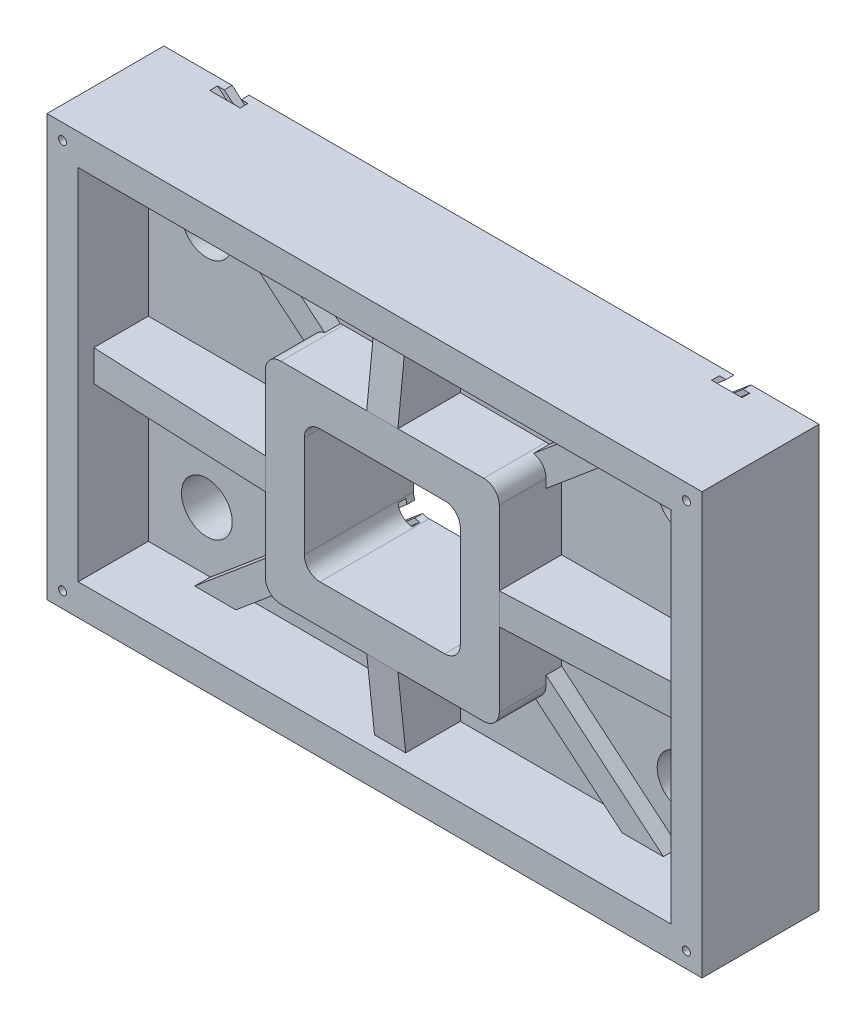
from build123d import *

# Parameters (mm, degrees)
SKETCH_1_W               = 840
SKETCH_1_H               = 540
SKETCH_1_R               = 32.5
EXTRUDE_1_DEPTH          = 150
SKETCH_2_W               = 760
SKETCH_2_H               = 460
CUT_EXTRUDE_1_DEPTH      = 90
CUT_EXTRUDE_3_DEPTH      = 468
CUT_EXTRUDE_3_DEPTH_BACK = 468
CUT_EXTRUDE_4_DEPTH      = 468
CUT_EXTRUDE_4_DEPTH_BACK = 468
EXTRUDE_2_DEPTH          = 80
EXTRUDE_3_DEPTH          = 20
EXTRUDE_3_DEPTH_BACK     = 20
EXTRUDE_4_DEPTH          = 20
EXTRUDE_4_DEPTH_BACK     = 20
EXTRUDE_5_DEPTH          = 20
HOLE_WIZARD_M12_2_D      = 10.2
HOLE_WIZARD_M12_2_DEPTH  = 35.25
HOLE_WIZARD_M12_2_TIP    = 3.064389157


with BuildPart() as part:
    # Sketch 1 → Extrude 1 (new body)
    with BuildSketch(Plane.XY):
        Rectangle(SKETCH_1_W, SKETCH_1_H)
        with Locations((305, 155)):
            Circle(SKETCH_1_R, mode=Mode.SUBTRACT)
        with Locations(Location((-305, 155, 0), (0, 0, 180))):
            Circle(SKETCH_1_R, mode=Mode.SUBTRACT)
        with Locations(Location((305, -155, 0), (0, 0, 180))):
            Circle(SKETCH_1_R, mode=Mode.SUBTRACT)
        with Locations((-305, -155)):
            Circle(SKETCH_1_R, mode=Mode.SUBTRACT)
        with BuildLine():
            Line((80, 85), (-80, 85))
            ThreePointArc((-80, 85), (-94.142135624, 79.142135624), (-100, 65))
            Line((-100, 65), (-100, -65))
            ThreePointArc((-100, -65), (-94.142135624, -79.142135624), (-80, -85))
            Line((-80, -85), (80, -85))
            ThreePointArc((80, -85), (94.142135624, -79.142135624), (100, -65))
            Line((100, -65), (100, 65))
            ThreePointArc((100, 65), (94.142135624, 79.142135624), (80, 85))
        make_face(mode=Mode.SUBTRACT)
    extrude(amount=EXTRUDE_1_DEPTH)

    # Sketch 2 → Cut-Extrude 1 (cut)
    with BuildSketch(Plane.XY.offset(150)):
        Rectangle(SKETCH_2_W, SKETCH_2_H)
    extrude(amount=-CUT_EXTRUDE_1_DEPTH, mode=Mode.SUBTRACT)

    # Sketch 4 → Cut-Extrude 3 (cut, two sides: drawn at the far end of the back side and taken through both)
    with BuildSketch(Plane(origin=(0, 0, 0), x_dir=(0, 0, -1), z_dir=(0.766044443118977, -0.6427876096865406, 0)).offset(-CUT_EXTRUDE_3_DEPTH_BACK)):
        Polygon((0, 7), (0, -7), (-10, -7), (-10, -12.5), (-20, -12.5), (-20, 12.5), (-10, 12.5), (-10, 7), align=None)
    extrude(amount=CUT_EXTRUDE_3_DEPTH + CUT_EXTRUDE_3_DEPTH_BACK, mode=Mode.SUBTRACT)

    # Sketch 5 → Cut-Extrude 4 (cut, two sides: drawn at the far end of the back side and taken through both)
    with BuildSketch(Plane(origin=(0, 0, 0), x_dir=(0, 0, 1), z_dir=(-0.7660444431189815, -0.6427876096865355, 0)).offset(-CUT_EXTRUDE_4_DEPTH_BACK)):
        Polygon((0, -7), (0, 7), (10, 7), (10, 12.5), (20, 12.5), (20, -12.5), (10, -12.5), (10, -7), align=None)
    extrude(amount=CUT_EXTRUDE_4_DEPTH + CUT_EXTRUDE_4_DEPTH_BACK, mode=Mode.SUBTRACT)

    # Sketch 6 → Extrude 2 (add)
    with BuildSketch(Plane.XY.offset(60)):
        with BuildLine():
            Line((130, 135), (-130, 135))
            ThreePointArc((-130, 135), (-144.142135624, 129.142135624), (-150, 115))
            Line((-150, 115), (-150, -115))
            ThreePointArc((-150, -115), (-144.142135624, -129.142135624), (-130, -135))
            Line((-130, -135), (130, -135))
            ThreePointArc((130, -135), (144.142135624, -129.142135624), (150, -115))
            Line((150, -115), (150, 115))
            ThreePointArc((150, 115), (144.142135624, 129.142135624), (130, 135))
        make_face()
        with BuildLine():
            Line((100, 65), (100, -65))
            ThreePointArc((100, -65), (94.142135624, -79.142135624), (80, -85))
            Line((80, -85), (-80, -85))
            ThreePointArc((-80, -85), (-94.142135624, -79.142135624), (-100, -65))
            Line((-100, -65), (-100, 65))
            ThreePointArc((-100, 65), (-94.142135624, 79.142135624), (-80, 85))
            Line((-80, 85), (80, 85))
            ThreePointArc((80, 85), (94.142135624, 79.142135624), (100, 65))
        make_face(mode=Mode.SUBTRACT)
    extrude(amount=EXTRUDE_2_DEPTH)

    # Sketch 7 → Extrude 3 (add, two sides: drawn at the far end of the back side and taken through both)
    with BuildSketch(Plane(origin=(0, 0, 0), x_dir=(1, 0, 0), z_dir=(0, 1, 0)).offset(-EXTRUDE_3_DEPTH_BACK)):
        Polygon((150, -140), (150, -60), (380, -60), (380, -130), align=None)
        Polygon((-150, -140), (-150, -60), (-380, -60), (-380, -130), align=None)
    extrude(amount=EXTRUDE_3_DEPTH + EXTRUDE_3_DEPTH_BACK)

    # Sketch 8 → Extrude 4 (add, two sides: drawn at the far end of the back side and taken through both)
    with BuildSketch(Plane(origin=(0, 0, 0), x_dir=(0, 0, -1), z_dir=(1, 0, 0)).offset(-EXTRUDE_4_DEPTH_BACK)):
        Polygon((-140, -135), (-60, -135), (-60, -230), (-130, -230), align=None)
        Polygon((-140, 135), (-60, 135), (-60, 230), (-130, 230), align=None)
    extrude(amount=EXTRUDE_4_DEPTH + EXTRUDE_4_DEPTH_BACK)

    # Sketch 9 → Extrude 5 (add)
    with BuildSketch(Plane.XY.offset(60)):
        with BuildLine():
            Line((300.550631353, -230), (150, -103.673020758))
            Line((150, -103.673020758), (150, -115))
            ThreePointArc((150, -115), (145.480981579, -127.662511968), (133.966079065, -134.602811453))
            Line((133.966079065, -134.602811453), (247.65602124, -230))
            Line((247.65602124, -230), (300.550631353, -230))
        make_face()
        with BuildLine():
            Line((-247.65602124, -230), (-133.966079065, -134.602811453))
            ThreePointArc((-133.966079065, -134.602811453), (-145.480981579, -127.662511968), (-150, -115))
            Line((-150, -115), (-150, -103.673020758))
            Line((-150, -103.673020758), (-300.550631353, -230))
            Line((-300.550631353, -230), (-247.65602124, -230))
        make_face()
        with BuildLine():
            Line((150, 103.673020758), (150, 115))
            ThreePointArc((150, 115), (145.480981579, 127.662511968), (133.966079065, 134.602811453))
            Line((133.966079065, 134.602811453), (247.65602124, 230))
            Line((247.65602124, 230), (300.550631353, 230))
            Line((300.550631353, 230), (150, 103.673020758))
        make_face()
        with BuildLine():
            Line((-150, 115), (-150, 103.673020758))
            Line((-150, 103.673020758), (-300.550631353, 230))
            Line((-300.550631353, 230), (-247.65602124, 230))
            Line((-247.65602124, 230), (-133.966079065, 134.602811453))
            ThreePointArc((-133.966079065, 134.602811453), (-145.480981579, 127.662511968), (-150, 115))
        make_face()
    extrude(amount=EXTRUDE_5_DEPTH)

    # Hole Wizard M12 _2
    with Locations(Plane.XY.offset(150)):
        with Locations((-400, 250), (-400, -250), (400, -250), (400, 250)):
            Hole(HOLE_WIZARD_M12_2_D / 2, depth=HOLE_WIZARD_M12_2_DEPTH)
            with Locations((0, 0, -(HOLE_WIZARD_M12_2_DEPTH + HOLE_WIZARD_M12_2_TIP / 2))):  # 118° drill point
                Cone(0, HOLE_WIZARD_M12_2_D / 2, HOLE_WIZARD_M12_2_TIP, mode=Mode.SUBTRACT)


solid = part.part
